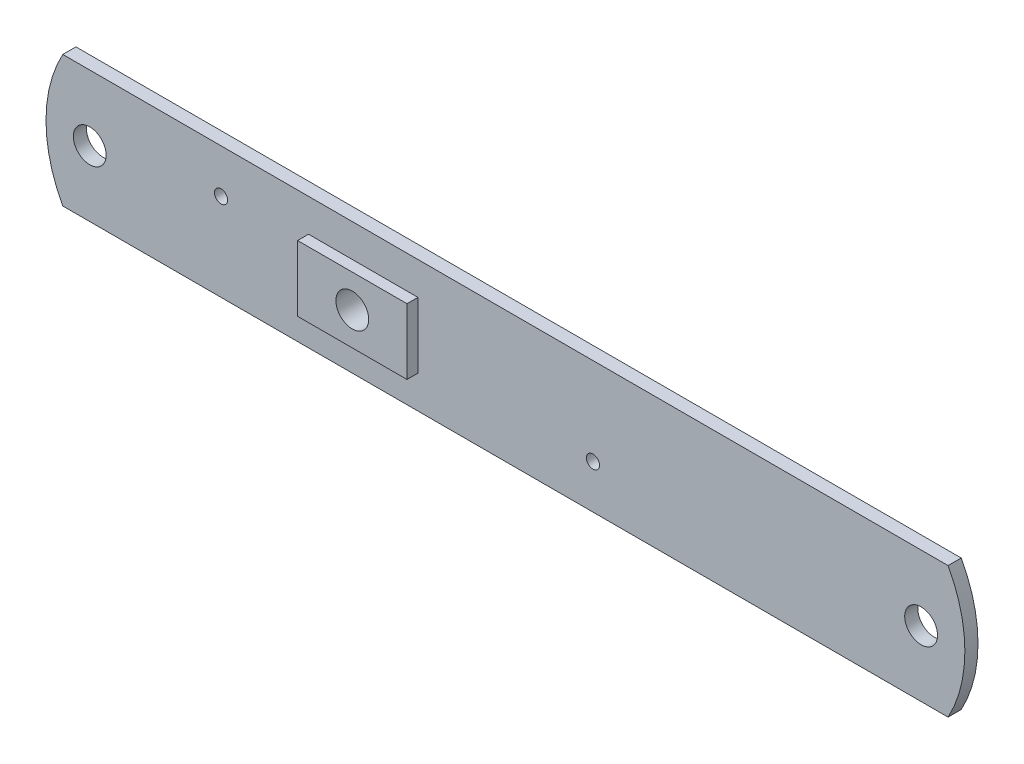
from build123d import *

# Parameters (mm, degrees)
ESQUISSE1_R             = 15
ESQUISSE1_R_2           = 6
EXTRUSION1_DEPTH        = 12
ESQUISSE2_W             = 100
ESQUISSE2_H             = 60
EXTRUSION2_DEPTH        = 10
ESQUISSE3_R             = 15
ENL_V_MAT_EXTRU_1_DEPTH = 849.813289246


with BuildPart() as part:
    # Esquisse1 → Extrusion1 (new body)
    with BuildSketch(Plane.XY):
        with BuildLine():
            Line((15.341439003, 0), (824.658560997, 0))
            ThreePointArc((824.658560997, 0), (840, -60), (824.658560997, -120))
            Line((824.658560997, -120), (15.341439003, -120))
            ThreePointArc((15.341439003, -120), (0, -60), (15.341439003, 0))
        make_face()
        with Locations((40, -60)):
            Circle(ESQUISSE1_R, mode=Mode.SUBTRACT)
        with Locations((160, -40)):
            Circle(ESQUISSE1_R_2, mode=Mode.SUBTRACT)
        with Locations((290, -60)):
            Circle(ESQUISSE1_R, mode=Mode.SUBTRACT)
        with Locations((800, -60)):
            Circle(ESQUISSE1_R, mode=Mode.SUBTRACT)
        with Locations((500, -80)):
            Circle(ESQUISSE1_R_2, mode=Mode.SUBTRACT)
    extrude(amount=EXTRUSION1_DEPTH)

    # Esquisse2 → Extrusion2 (add)
    with BuildSketch(Plane.XY.offset(12)):
        with Locations((290, -60)):
            Rectangle(ESQUISSE2_W, ESQUISSE2_H)
    extrude(amount=EXTRUSION2_DEPTH)

    # Esquisse3 → Enl_v. mat.-Extru.1 (cut, through all)
    with BuildSketch(Plane.XY.offset(22)):
        with Locations((290, -60)):
            Circle(ESQUISSE3_R)
    extrude(amount=-ENL_V_MAT_EXTRU_1_DEPTH, mode=Mode.SUBTRACT)


solid = part.part
